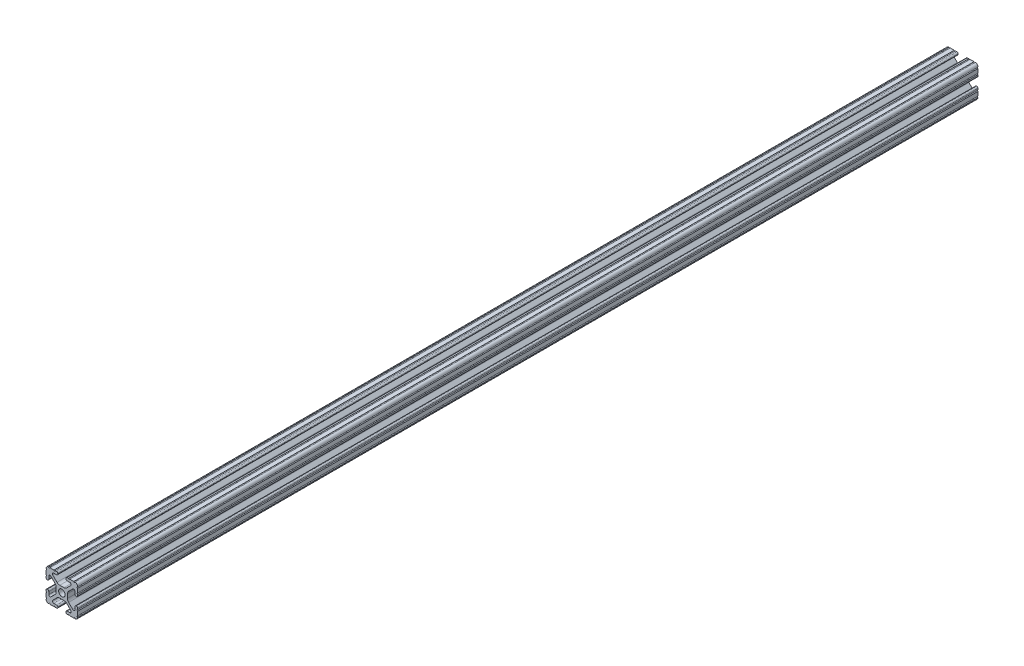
from build123d import *

# Parameters (mm, degrees)
SKETCH1_R           = 2.6035
BOSS_EXTRUDE1_DEPTH = 721.4108


with BuildPart() as part:
    # Sketch1 → Boss-Extrude1 (new body)
    with BuildSketch(Plane.XY):
        with BuildLine():
            Line((-7.179650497, -8.645192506), (-3.952270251, -5.423690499))
            ThreePointArc((-3.952270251, -5.423690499), (-2.922936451, -4.736929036), (-1.709253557, -4.4958))
            Line((-1.709253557, -4.4958), (1.709253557, -4.4958))
            ThreePointArc((1.709253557, -4.4958), (2.922936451, -4.736929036), (3.952270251, -5.423690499))
            Line((3.952270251, -5.423690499), (7.179650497, -8.645192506))
            ThreePointArc((7.179650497, -8.645192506), (7.41473083, -9.822813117), (6.416408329, -10.4902))
            Line((6.416408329, -10.4902), (4.287512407, -10.4902))
            ThreePointArc((4.287512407, -10.4902), (3.54574862, -10.79744862), (3.2385, -11.539212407))
            Line((3.2385, -11.539212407), (3.2385, -11.650987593))
            ThreePointArc((3.2385, -11.650987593), (3.54574862, -12.39275138), (4.287512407, -12.7))
            Line((4.287512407, -12.7), (5.317126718, -12.7))
            ThreePointArc((5.317126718, -12.7), (5.825126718, -12.192), (6.333126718, -12.7))
            Line((6.333126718, -12.7), (9.550443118, -12.7))
            ThreePointArc((9.550443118, -12.7), (10.058366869, -12.192000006), (10.566443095, -12.699847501))
            ThreePointArc((10.566443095, -12.699847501), (12.082537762, -12.08250727), (12.699846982, -10.566399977))
            ThreePointArc((12.699846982, -10.566399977), (12.192000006, -10.058323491), (12.7, -9.5504))
            Line((12.7, -9.5504), (12.7, -6.3330836))
            ThreePointArc((12.7, -6.3330836), (12.192, -5.8250836), (12.7, -5.3170836))
            Line((12.7, -5.3170836), (12.7, -4.287469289))
            ThreePointArc((12.7, -4.287469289), (12.39275138, -3.545705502), (11.650987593, -3.238456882))
            Line((11.650987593, -3.238456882), (11.539212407, -3.238456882))
            ThreePointArc((11.539212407, -3.238456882), (10.79744862, -3.545705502), (10.4902, -4.287469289))
            Line((10.4902, -4.287469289), (10.4902, -6.402089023))
            ThreePointArc((10.4902, -6.402089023), (9.856505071, -7.351067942), (8.737131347, -7.129408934))
            Line((8.737131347, -7.129408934), (5.441005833, -3.840816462))
            ThreePointArc((5.441005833, -3.840816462), (4.750877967, -2.809883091), (4.5085, -1.593185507))
            Line((4.5085, -1.593185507), (4.5085, 1.593185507))
            ThreePointArc((4.5085, 1.593185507), (4.750877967, 2.809883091), (5.441005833, 3.840816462))
            Line((5.441005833, 3.840816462), (8.737131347, 7.129408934))
            ThreePointArc((8.737131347, 7.129408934), (9.856505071, 7.351067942), (10.4902, 6.402089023))
            Line((10.4902, 6.402089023), (10.4902, 4.287469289))
            ThreePointArc((10.4902, 4.287469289), (10.79744862, 3.545705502), (11.539212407, 3.238456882))
            Line((11.539212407, 3.238456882), (11.650987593, 3.238456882))
            ThreePointArc((11.650987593, 3.238456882), (12.39275138, 3.545705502), (12.7, 4.287469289))
            Line((12.7, 4.287469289), (12.7, 5.3170836))
            ThreePointArc((12.7, 5.3170836), (12.192, 5.8250836), (12.7, 6.3330836))
            Line((12.7, 6.3330836), (12.7, 9.5504))
            ThreePointArc((12.7, 9.5504), (12.192000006, 10.058323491), (12.699846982, 10.566399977))
            ThreePointArc((12.699846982, 10.566399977), (12.082537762, 12.08250727), (10.566443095, 12.699847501))
            ThreePointArc((10.566443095, 12.699847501), (10.058366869, 12.192000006), (9.550443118, 12.7))
            Line((9.550443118, 12.7), (6.333126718, 12.7))
            ThreePointArc((6.333126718, 12.7), (5.825126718, 12.192), (5.317126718, 12.7))
            Line((5.317126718, 12.7), (4.287512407, 12.7))
            ThreePointArc((4.287512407, 12.7), (3.54574862, 12.39275138), (3.2385, 11.650987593))
            Line((3.2385, 11.650987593), (3.2385, 11.539212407))
            ThreePointArc((3.2385, 11.539212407), (3.54574862, 10.79744862), (4.287512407, 10.4902))
            Line((4.287512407, 10.4902), (6.476788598, 10.4902))
            ThreePointArc((6.476788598, 10.4902), (7.432222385, 9.85140422), (7.207036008, 8.724370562))
            Line((7.207036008, 8.724370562), (3.898272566, 5.423169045))
            ThreePointArc((3.898272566, 5.423169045), (2.869120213, 4.736787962), (1.655778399, 4.4958))
            Line((1.655778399, 4.4958), (-1.655778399, 4.4958))
            ThreePointArc((-1.655778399, 4.4958), (-2.869120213, 4.736787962), (-3.898272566, 5.423169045))
            Line((-3.898272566, 5.423169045), (-7.207036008, 8.724370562))
            ThreePointArc((-7.207036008, 8.724370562), (-7.432222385, 9.85140422), (-6.476788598, 10.4902))
            Line((-6.476788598, 10.4902), (-4.287512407, 10.4902))
            ThreePointArc((-4.287512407, 10.4902), (-3.54574862, 10.79744862), (-3.2385, 11.539212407))
            Line((-3.2385, 11.539212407), (-3.2385, 11.650987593))
            ThreePointArc((-3.2385, 11.650987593), (-3.54574862, 12.39275138), (-4.287512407, 12.7))
            Line((-4.287512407, 12.7), (-5.317126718, 12.7))
            ThreePointArc((-5.317126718, 12.7), (-5.825126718, 12.192), (-6.333126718, 12.7))
            Line((-6.333126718, 12.7), (-9.550443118, 12.7))
            ThreePointArc((-9.550443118, 12.7), (-10.058366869, 12.192000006), (-10.566443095, 12.699847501))
            ThreePointArc((-10.566443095, 12.699847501), (-12.082537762, 12.08250727), (-12.699846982, 10.566399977))
            ThreePointArc((-12.699846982, 10.566399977), (-12.192000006, 10.058323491), (-12.7, 9.5504))
            Line((-12.7, 9.5504), (-12.7, 6.3330836))
            ThreePointArc((-12.7, 6.3330836), (-12.192, 5.8250836), (-12.7, 5.3170836))
            Line((-12.7, 5.3170836), (-12.7, 4.287469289))
            ThreePointArc((-12.7, 4.287469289), (-12.39275138, 3.545705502), (-11.650987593, 3.238456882))
            Line((-11.650987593, 3.238456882), (-11.539212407, 3.238456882))
            ThreePointArc((-11.539212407, 3.238456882), (-10.79744862, 3.545705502), (-10.4902, 4.287469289))
            Line((-10.4902, 4.287469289), (-10.4902, 6.402089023))
            ThreePointArc((-10.4902, 6.402089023), (-9.856505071, 7.351067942), (-8.737131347, 7.129408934))
            Line((-8.737131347, 7.129408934), (-5.441005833, 3.840816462))
            ThreePointArc((-5.441005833, 3.840816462), (-4.750877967, 2.809883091), (-4.5085, 1.593185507))
            Line((-4.5085, 1.593185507), (-4.5085, -1.593185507))
            ThreePointArc((-4.5085, -1.593185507), (-4.750877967, -2.809883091), (-5.441005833, -3.840816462))
            Line((-5.441005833, -3.840816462), (-8.737131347, -7.129408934))
            ThreePointArc((-8.737131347, -7.129408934), (-9.856505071, -7.351067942), (-10.4902, -6.402089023))
            Line((-10.4902, -6.402089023), (-10.4902, -4.287469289))
            ThreePointArc((-10.4902, -4.287469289), (-10.79744862, -3.545705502), (-11.539212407, -3.238456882))
            Line((-11.539212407, -3.238456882), (-11.650987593, -3.238456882))
            ThreePointArc((-11.650987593, -3.238456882), (-12.39275138, -3.545705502), (-12.7, -4.287469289))
            Line((-12.7, -4.287469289), (-12.7, -5.3170836))
            ThreePointArc((-12.7, -5.3170836), (-12.192, -5.8250836), (-12.7, -6.3330836))
            Line((-12.7, -6.3330836), (-12.7, -9.5504))
            ThreePointArc((-12.7, -9.5504), (-12.192000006, -10.058323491), (-12.699846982, -10.566399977))
            ThreePointArc((-12.699846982, -10.566399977), (-12.082537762, -12.08250727), (-10.566443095, -12.699847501))
            ThreePointArc((-10.566443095, -12.699847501), (-10.058366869, -12.192000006), (-9.550443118, -12.7))
            Line((-9.550443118, -12.7), (-6.333126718, -12.7))
            ThreePointArc((-6.333126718, -12.7), (-5.825126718, -12.192), (-5.317126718, -12.7))
            Line((-5.317126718, -12.7), (-4.287512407, -12.7))
            ThreePointArc((-4.287512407, -12.7), (-3.54574862, -12.39275138), (-3.2385, -11.650987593))
            Line((-3.2385, -11.650987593), (-3.2385, -11.539212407))
            ThreePointArc((-3.2385, -11.539212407), (-3.54574862, -10.79744862), (-4.287512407, -10.4902))
            Line((-4.287512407, -10.4902), (-6.416408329, -10.4902))
            ThreePointArc((-6.416408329, -10.4902), (-7.41473083, -9.822813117), (-7.179650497, -8.645192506))
        make_face()
        with Locations(Location((0, 0, 0), (0, 0, 270))):
            Circle(SKETCH1_R, mode=Mode.SUBTRACT)
    extrude(amount=BOSS_EXTRUDE1_DEPTH)


solid = part.part
